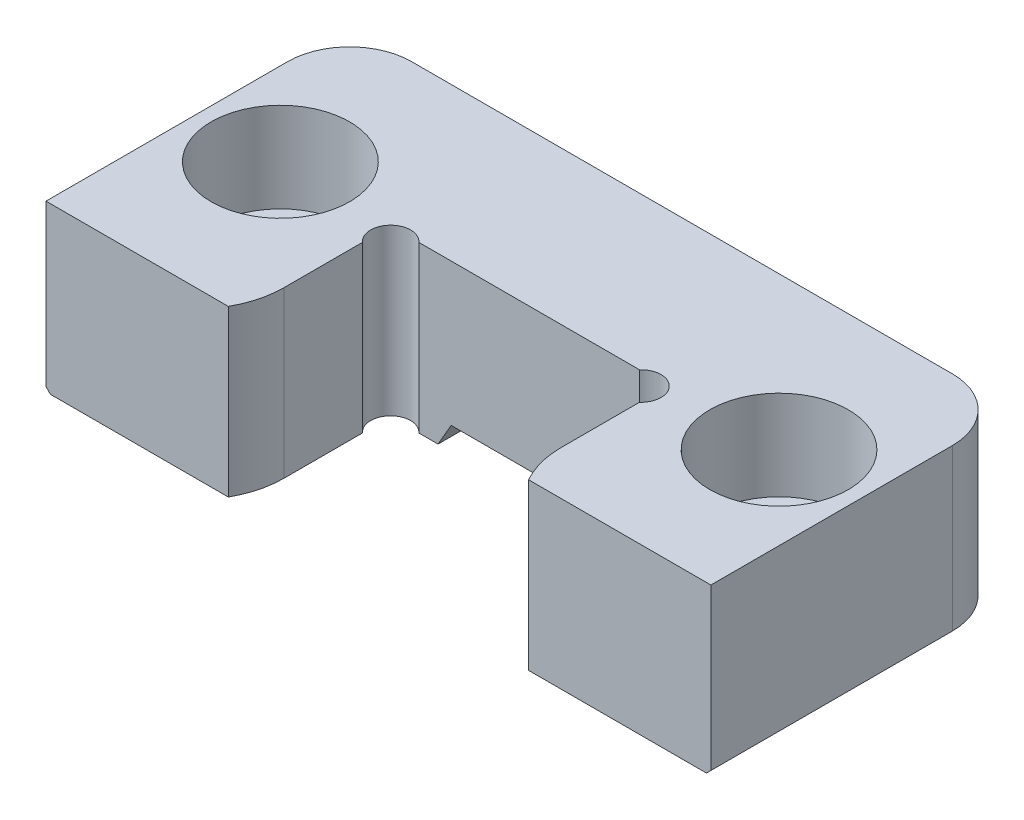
from build123d import *

# Parameters (mm, degrees)
BOSS_EXTRUDE1_DEPTH     = 18.923
FILLET1_R               = 7.112
CUT_EXTRUDE1_DEPTH      = 55.959901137
SKETCH3_R               = 2.286
CUT_EXTRUDE2_DEPTH      = 55.959901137
CUT_EXTRUDE3_DEPTH      = 55.959901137
CHAMFER1_SIZE           = 0.508
CHAMFER5_SIZE           = 3.81
CHAMFER5_SIZE2          = 1.020886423
F_3_8_CBORE_D           = 10.31748
F_3_8_CBORE_CBORE_D     = 15.875
F_3_8_CBORE_CBORE_DEPTH = 10.287


with BuildPart() as part:
    # Sketch1 → Boss-Extrude1 (new body)
    with BuildSketch(Plane(origin=(0, 0, 0), x_dir=(1, 0, 0), z_dir=(0, 1, 0))):
        Polygon((15.875, 0), (38.1, 0), (38.1, 34.798), (-38.1, 34.798), (-38.1, 0), (-15.875, 0), (-15.875, 17.272), (15.875, 17.272), align=None)
    extrude(amount=-BOSS_EXTRUDE1_DEPTH)

    # Fillet1
    fillet1_edges = [part.edges().sort_by_distance(p)[0] for p in [
        (-38.1, -9.4615, -34.798),
        (38.1, -9.4615, -34.798),
    ]]
    fillet(fillet1_edges, radius=FILLET1_R)

    # Sketch2 → Cut-Extrude1 (cut, through all)
    with BuildSketch(Plane(origin=(0, 0, 0), x_dir=(1, 0, 0), z_dir=(0, 1, 0))):
        with BuildLine():
            Line((-15.875, 5.08), (-15.875, 12.7))
            Line((-15.875, 12.7), (15.875, 12.7))
            Line((15.875, 12.7), (15.875, 5.08))
            ThreePointArc((15.875, 5.08), (16.213527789, 2.454140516), (17.206973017, 0))
            Line((17.206973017, 0), (28.575, 0))
            Line((28.575, 0), (28.575, -12.7))
            Line((28.575, -12.7), (-28.575, -12.7))
            Line((-28.575, -12.7), (-28.575, 0))
            Line((-28.575, 0), (-17.206973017, 0))
            ThreePointArc((-17.206973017, 0), (-16.213527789, 2.454140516), (-15.875, 5.08))
        make_face()
    extrude(amount=-CUT_EXTRUDE1_DEPTH, mode=Mode.SUBTRACT)

    # Sketch3 → Cut-Extrude2 (cut, through all)
    with BuildSketch(Plane(origin=(0, 0, 0), x_dir=(1, 0, 0), z_dir=(0, 1, 0))):
        with Locations((-14.351, 15.748)):
            Circle(SKETCH3_R)
        with Locations((14.351, 15.748)):
            Circle(SKETCH3_R)
    extrude(amount=-CUT_EXTRUDE2_DEPTH, mode=Mode.SUBTRACT)

    # Sketch5 → Cut-Extrude3 (cut, through all)
    with BuildSketch(Plane(origin=(0, 0, -34.798), x_dir=(-1, 0, 0), z_dir=(0, 0, -1))):
        Polygon((-9.525, -17.3355), (9.525, -17.3355), (10.441543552, -18.923), (-10.441543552, -18.923), align=None)
    extrude(amount=-CUT_EXTRUDE3_DEPTH, mode=Mode.SUBTRACT)

    # Chamfer1
    chamfer1_edges = [part.edges().sort_by_distance(p)[0] for p in [
        (38.1, -18.923, -13.843),
        (20.714771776, -18.923, -34.798),
        (-38.1, -18.923, -13.843),
        (-36.016943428, -18.923, -32.714943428),
        (36.016943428, -18.923, -32.714943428),
        (-20.714771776, -18.923, -34.798),
    ]]
    chamfer(chamfer1_edges, length=CHAMFER1_SIZE)

    # Chamfer5
    chamfer5_edges = [part.edges().sort_by_distance(p)[0] for p in [
        (0, -17.3355, -17.272),
    ]]
    chamfer5_side = [part.faces().sort_by_distance(p)[0] for p in [
        (0, -17.3355, -26.035),
    ]]
    chamfer(chamfer5_edges, length=CHAMFER5_SIZE, length2=CHAMFER5_SIZE2, reference=chamfer5_side[0])

    # 3_8_ CBORE (through all)
    with Locations(Plane(origin=(9.083120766, 0, -5.226040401), x_dir=(-1, 0, 0), z_dir=(0, 1, 0))):
        with Locations((37.658120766, -12.109459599), (-19.491879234, -12.109459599)):
            CounterBoreHole(F_3_8_CBORE_D / 2, F_3_8_CBORE_CBORE_D / 2, F_3_8_CBORE_CBORE_DEPTH)


solid = part.part
